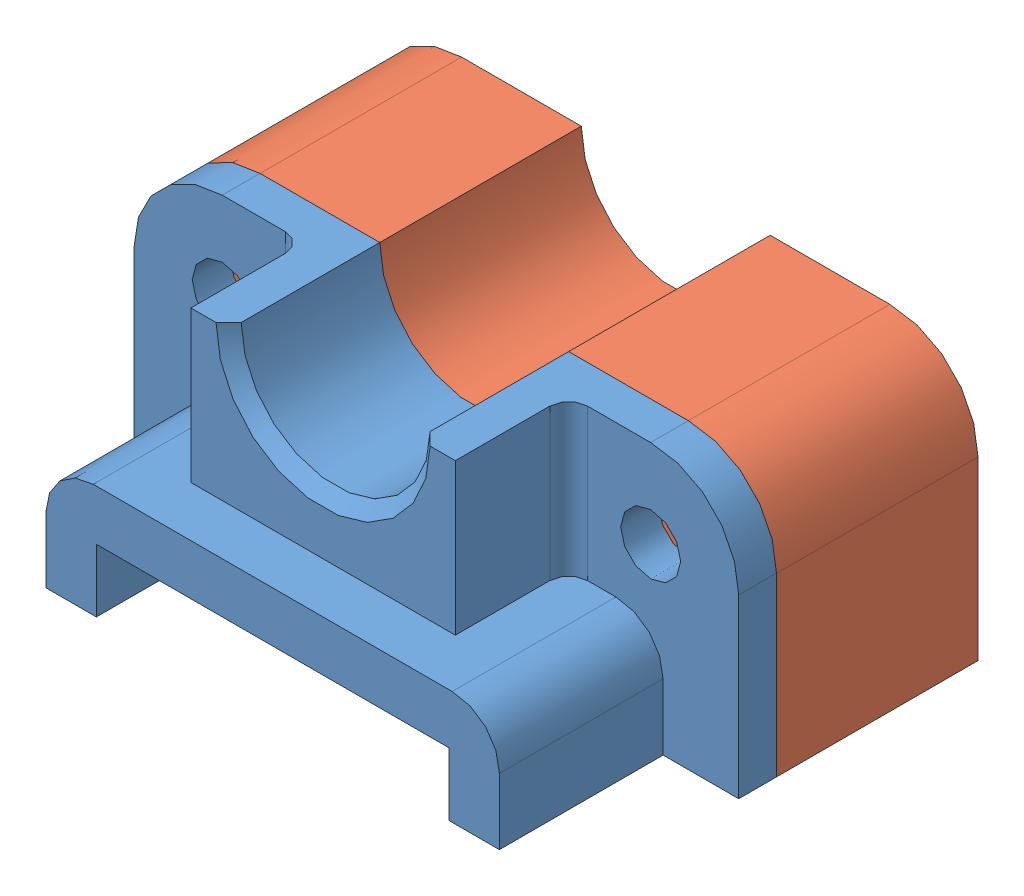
SolidWorks assembly Bearing Block Assembly.SLDASM, configuration Default (file format 4700). Lengths in mm.
Overall size (101.6 44.45 67.73).
2 component instances, 2 part files, 3 mates.
Components (placement in the parent):
- Bearing Rest-1: Bearing Rest.SLDPRT [Default] at origin size (101.6 44.45 33.87)
- Bearing Block-2: Bearing Block.SLDPRT [Default] at (101.6 0 0) size (101.6 44.45 33.87)
Mates (geometry in assembly coordinates):
- Coincident1: coincident anti-aligned: plane of Bearing Rest-1 through (0 0 0) normal (0 0 -1); plane of Bearing Block-2 through (86.7833 29.6333 0) normal (0 0 1)
- Coincident3: coincident aligned: plane of Bearing Block-2 through (34.925 44.45 -33.8667) normal (0 1 0); plane of Bearing Rest-1 through (101.6 44.45 6.35) normal (0 1 0)
- Concentric1: concentric aligned: cylinder of Bearing Rest-1 through (50.8 44.45 0) axis (0 0 1) radius 15.875; cylinder of Bearing Block-2 through (50.8 44.45 -33.8667) axis (0 0 1) radius 15.875
